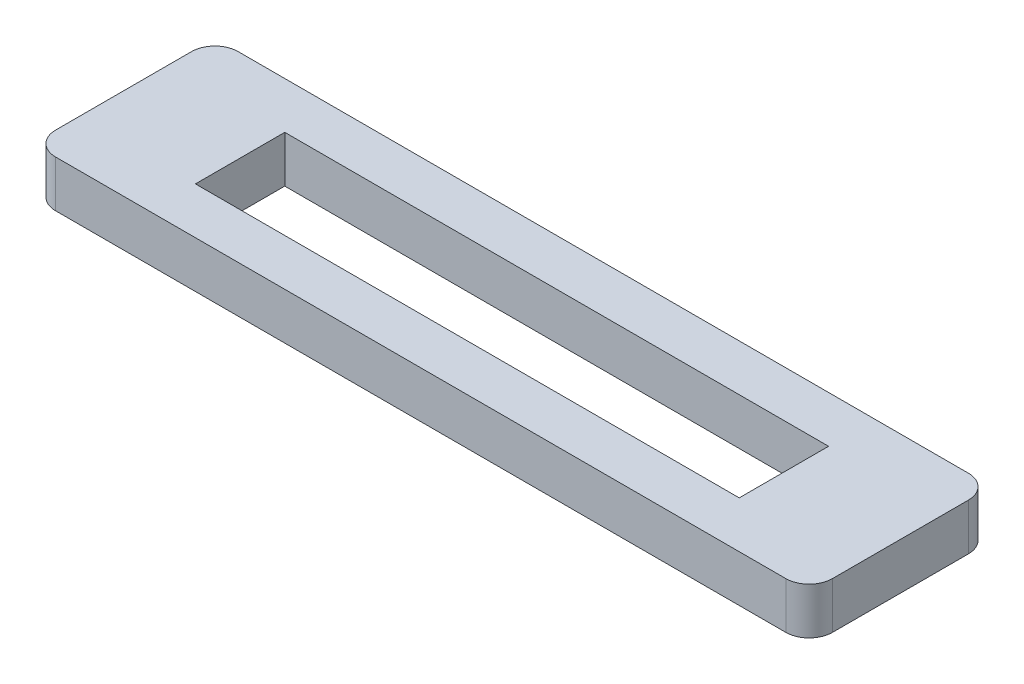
from build123d import *

# Parameters (mm, degrees)
SKETCH1_W           = 100
SKETCH1_H           = 23.5
SKETCH1_W_2         = 70
SKETCH1_H_2         = 11.5
BOSS_EXTRUDE1_DEPTH = 6
FILLET1_R           = 3


with BuildPart() as part:
    # Sketch1 → Boss-Extrude1 (new body)
    with BuildSketch(Plane(origin=(0, 0, 0), x_dir=(1, 0, 0), z_dir=(0, 1, 0))):
        Rectangle(SKETCH1_W, SKETCH1_H)
        Rectangle(SKETCH1_W_2, SKETCH1_H_2, mode=Mode.SUBTRACT)
    extrude(amount=BOSS_EXTRUDE1_DEPTH)

    # Fillet1
    fillet1_edges = [part.edges().sort_by_distance(p)[0] for p in [
        (50, 3, 11.75),
        (-50, 3, 11.75),
        (-50, 3, -11.75),
        (50, 3, -11.75),
    ]]
    fillet(fillet1_edges, radius=FILLET1_R)


solid = part.part
